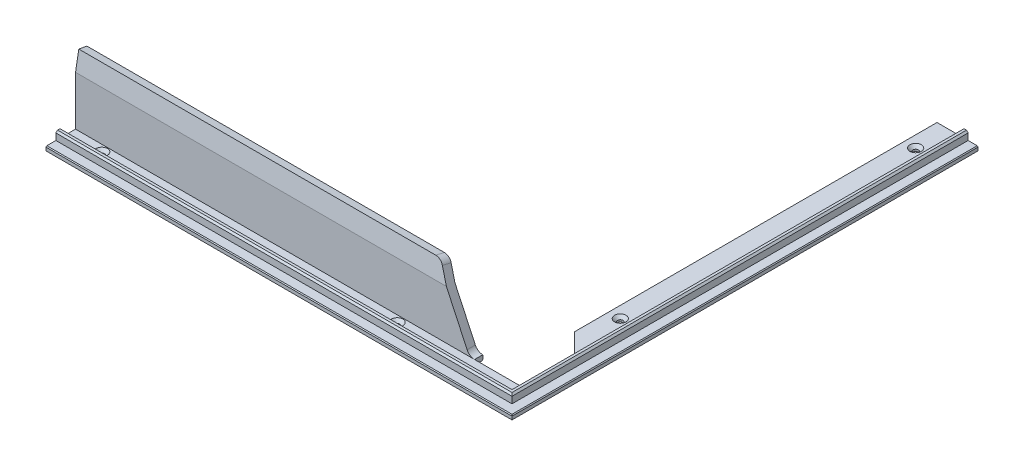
ISO-10303-21;
HEADER;
FILE_DESCRIPTION(('STEP AP214'),'2;1');
FILE_NAME('part.step','',(''),(''),'','','');
FILE_SCHEMA(('AUTOMOTIVE_DESIGN { 1 0 10303 214 1 1 1 1 }'));
ENDSEC;
DATA;
#1=APPLICATION_CONTEXT('core data for automotive mechanical design processes');
#2=APPLICATION_PROTOCOL_DEFINITION('international standard','automotive_design',2000,#1);
#3=PRODUCT_CONTEXT('',#1,'mechanical');
#4=PRODUCT('Part','Part','',(#3));
#5=PRODUCT_RELATED_PRODUCT_CATEGORY('part','',(#4));
#6=PRODUCT_DEFINITION_FORMATION('','',#4);
#7=PRODUCT_DEFINITION_CONTEXT('part definition',#1,'design');
#8=PRODUCT_DEFINITION('design','',#6,#7);
#9=PRODUCT_DEFINITION_SHAPE('','',#8);
#10=(LENGTH_UNIT() NAMED_UNIT(*) SI_UNIT(.MILLI.,.METRE.));
#11=(NAMED_UNIT(*) PLANE_ANGLE_UNIT() SI_UNIT($,.RADIAN.));
#12=(NAMED_UNIT(*) SI_UNIT($,.STERADIAN.) SOLID_ANGLE_UNIT());
#13=UNCERTAINTY_MEASURE_WITH_UNIT(LENGTH_MEASURE(1.E-05),#10,'distance_accuracy_value','');
#14=(GEOMETRIC_REPRESENTATION_CONTEXT(3) GLOBAL_UNCERTAINTY_ASSIGNED_CONTEXT((#13)) GLOBAL_UNIT_ASSIGNED_CONTEXT((#10,
#11,#12)) REPRESENTATION_CONTEXT('',''));
#15=CARTESIAN_POINT('',(0.,0.,0.));
#16=DIRECTION('',(0.,0.,1.));
#17=DIRECTION('',(1.,0.,0.));
#18=AXIS2_PLACEMENT_3D('',#15,#16,#17);
#19=CARTESIAN_POINT('',(518.,3.,0.));
#20=DIRECTION('',(0.,-1.,0.));
#21=DIRECTION('',(0.,0.,-1.));
#22=AXIS2_PLACEMENT_3D('',#19,#20,#21);
#23=PLANE('',#22);
#24=CARTESIAN_POINT('',(525.,3.,-241.));
#25=DIRECTION('',(0.,-1.,0.));
#26=DIRECTION('',(0.,0.,1.));
#27=AXIS2_PLACEMENT_3D('',#24,#25,#26);
#28=CIRCLE('',#27,3.5);
#29=CARTESIAN_POINT('',(525.,3.,-237.5));
#30=VERTEX_POINT('',#29);
#31=EDGE_CURVE('E377',#30,#30,#28,.T.);
#32=ORIENTED_EDGE('',*,*,#31,.T.);
#33=EDGE_LOOP('',(#32));
#34=FACE_BOUND('',#33,.T.);
#35=CARTESIAN_POINT('',(525.,3.,-61.0000000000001));
#36=DIRECTION('',(0.,-1.,0.));
#37=DIRECTION('',(0.,0.,1.));
#38=AXIS2_PLACEMENT_3D('',#35,#36,#37);
#39=CIRCLE('',#38,3.5);
#40=CARTESIAN_POINT('',(525.,3.,-57.5000000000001));
#41=VERTEX_POINT('',#40);
#42=EDGE_CURVE('E365',#41,#41,#39,.T.);
#43=ORIENTED_EDGE('',*,*,#42,.T.);
#44=EDGE_LOOP('',(#43));
#45=FACE_BOUND('',#44,.T.);
#46=DIRECTION('',(0.,0.,-1.));
#47=VECTOR('',#46,1.);
#48=CARTESIAN_POINT('',(518.,3.,0.));
#49=LINE('',#48,#47);
#50=CARTESIAN_POINT('',(518.,3.,-40.));
#51=VERTEX_POINT('',#50);
#52=CARTESIAN_POINT('',(518.,3.,-261.));
#53=VERTEX_POINT('',#52);
#54=EDGE_CURVE('E435',#51,#53,#49,.T.);
#55=ORIENTED_EDGE('',*,*,#54,.F.);
#56=DIRECTION('',(-0.707106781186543,0.,-0.707106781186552));
#57=VECTOR('',#56,1.);
#58=CARTESIAN_POINT('',(534.,3.,-23.9999999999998));
#59=LINE('',#58,#57);
#60=CARTESIAN_POINT('',(534.,3.,-23.9999999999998));
#61=VERTEX_POINT('',#60);
#62=EDGE_CURVE('E266',#61,#51,#59,.T.);
#63=ORIENTED_EDGE('',*,*,#62,.F.);
#64=DIRECTION('',(0.,0.,-1.));
#65=VECTOR('',#64,1.);
#66=CARTESIAN_POINT('',(534.,3.,14.));
#67=LINE('',#66,#65);
#68=CARTESIAN_POINT('',(534.,3.,-261.));
#69=VERTEX_POINT('',#68);
#70=EDGE_CURVE('E413',#61,#69,#67,.T.);
#71=ORIENTED_EDGE('',*,*,#70,.T.);
#72=DIRECTION('',(1.,0.,0.));
#73=VECTOR('',#72,1.);
#74=CARTESIAN_POINT('',(518.,3.,-261.));
#75=LINE('',#74,#73);
#76=EDGE_CURVE('E439',#53,#69,#75,.T.);
#77=ORIENTED_EDGE('',*,*,#76,.F.);
#78=EDGE_LOOP('',(#55,#63,#71,#77));
#79=FACE_BOUND('',#78,.T.);
#80=ADVANCED_FACE('F40',(#34,#45,#79),#23,.F.);
#81=CARTESIAN_POINT('',(279.,3.,8.99999999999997));
#82=DIRECTION('',(0.,-1.,0.));
#83=DIRECTION('',(0.,0.,1.));
#84=AXIS2_PLACEMENT_3D('',#81,#82,#83);
#85=CIRCLE('',#84,3.5);
#86=CARTESIAN_POINT('',(279.,3.,12.5));
#87=VERTEX_POINT('',#86);
#88=EDGE_CURVE('E329',#87,#87,#85,.T.);
#89=ORIENTED_EDGE('',*,*,#88,.T.);
#90=EDGE_LOOP('',(#89));
#91=FACE_BOUND('',#90,.T.);
#92=CARTESIAN_POINT('',(459.,3.,8.99999999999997));
#93=DIRECTION('',(0.,-1.,0.));
#94=DIRECTION('',(0.,0.,1.));
#95=AXIS2_PLACEMENT_3D('',#92,#93,#94);
#96=CIRCLE('',#95,3.5);
#97=CARTESIAN_POINT('',(459.,3.,12.5));
#98=VERTEX_POINT('',#97);
#99=EDGE_CURVE('E353',#98,#98,#96,.T.);
#100=ORIENTED_EDGE('',*,*,#99,.T.);
#101=EDGE_LOOP('',(#100));
#102=FACE_BOUND('',#101,.T.);
#103=CARTESIAN_POINT('',(534.,3.,14.));
#104=VERTEX_POINT('',#103);
#105=CARTESIAN_POINT('',(534.,3.,5.));
#106=VERTEX_POINT('',#105);
#107=EDGE_CURVE('E395',#104,#106,#67,.T.);
#108=ORIENTED_EDGE('',*,*,#107,.T.);
#109=DIRECTION('',(1.,0.,0.));
#110=VECTOR('',#109,1.);
#111=CARTESIAN_POINT('',(502.185351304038,3.,5.));
#112=LINE('',#111,#110);
#113=CARTESIAN_POINT('',(502.185351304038,3.,5.));
#114=VERTEX_POINT('',#113);
#115=EDGE_CURVE('E270',#114,#106,#112,.T.);
#116=ORIENTED_EDGE('',*,*,#115,.F.);
#117=DIRECTION('',(-1.,0.,0.));
#118=VECTOR('',#117,1.);
#119=CARTESIAN_POINT('',(499.,3.,5.));
#120=LINE('',#119,#118);
#121=CARTESIAN_POINT('',(259.,3.,5.));
#122=VERTEX_POINT('',#121);
#123=EDGE_CURVE('E325',#114,#122,#120,.T.);
#124=ORIENTED_EDGE('',*,*,#123,.T.);
#125=DIRECTION('',(0.,0.,-1.));
#126=VECTOR('',#125,1.);
#127=CARTESIAN_POINT('',(259.,3.,23.));
#128=LINE('',#127,#126);
#129=CARTESIAN_POINT('',(259.,3.,14.));
#130=VERTEX_POINT('',#129);
#131=EDGE_CURVE('E443',#130,#122,#128,.T.);
#132=ORIENTED_EDGE('',*,*,#131,.F.);
#133=DIRECTION('',(1.,0.,0.));
#134=VECTOR('',#133,1.);
#135=CARTESIAN_POINT('',(259.,3.,14.));
#136=LINE('',#135,#134);
#137=EDGE_CURVE('E409',#130,#104,#136,.T.);
#138=ORIENTED_EDGE('',*,*,#137,.T.);
#139=EDGE_LOOP('',(#108,#116,#124,#132,#138));
#140=FACE_BOUND('',#139,.T.);
#141=ADVANCED_FACE('F634',(#91,#102,#140),#23,.F.);
#142=CARTESIAN_POINT('',(537.,3.,-261.));
#143=VERTEX_POINT('',#142);
#144=CARTESIAN_POINT('',(542.5,3.,-261.));
#145=VERTEX_POINT('',#144);
#146=EDGE_CURVE('E438',#143,#145,#75,.T.);
#147=ORIENTED_EDGE('',*,*,#146,.F.);
#148=DIRECTION('',(0.,0.,1.));
#149=VECTOR('',#148,1.);
#150=CARTESIAN_POINT('',(537.,3.,-261.));
#151=LINE('',#150,#149);
#152=CARTESIAN_POINT('',(537.,3.,17.));
#153=VERTEX_POINT('',#152);
#154=EDGE_CURVE('E400',#143,#153,#151,.T.);
#155=ORIENTED_EDGE('',*,*,#154,.T.);
#156=DIRECTION('',(-1.,0.,0.));
#157=VECTOR('',#156,1.);
#158=CARTESIAN_POINT('',(537.,3.,17.));
#159=LINE('',#158,#157);
#160=CARTESIAN_POINT('',(259.,3.,17.));
#161=VERTEX_POINT('',#160);
#162=EDGE_CURVE('E404',#153,#161,#159,.T.);
#163=ORIENTED_EDGE('',*,*,#162,.T.);
#164=CARTESIAN_POINT('',(259.,3.,22.5));
#165=VERTEX_POINT('',#164);
#166=EDGE_CURVE('E444',#165,#161,#128,.T.);
#167=ORIENTED_EDGE('',*,*,#166,.F.);
#168=DIRECTION('',(-1.,0.,0.));
#169=VECTOR('',#168,1.);
#170=CARTESIAN_POINT('',(518.,3.,22.5));
#171=LINE('',#170,#169);
#172=CARTESIAN_POINT('',(542.5,3.,22.5));
#173=VERTEX_POINT('',#172);
#174=EDGE_CURVE('E534',#173,#165,#171,.T.);
#175=ORIENTED_EDGE('',*,*,#174,.F.);
#176=DIRECTION('',(0.,0.,1.));
#177=VECTOR('',#176,1.);
#178=CARTESIAN_POINT('',(542.5,3.,0.));
#179=LINE('',#178,#177);
#180=EDGE_CURVE('E538',#145,#173,#179,.T.);
#181=ORIENTED_EDGE('',*,*,#180,.F.);
#182=EDGE_LOOP('',(#147,#155,#163,#167,#175,#181));
#183=FACE_BOUND('',#182,.T.);
#184=ADVANCED_FACE('F686',(#183),#23,.F.);
#185=CARTESIAN_POINT('',(259.,3.,0.));
#186=DIRECTION('',(0.,0.,1.));
#187=DIRECTION('',(-1.,0.,0.));
#188=AXIS2_PLACEMENT_3D('',#185,#186,#187);
#189=PLANE('',#188);
#190=CARTESIAN_POINT('',(502.185351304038,8.,0.));
#191=DIRECTION('',(0.,0.,-1.));
#192=DIRECTION('',(-1.,0.,0.));
#193=AXIS2_PLACEMENT_3D('',#190,#191,#192);
#194=CIRCLE('',#193,5.);
#195=CARTESIAN_POINT('',(502.185351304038,3.,0.));
#196=VERTEX_POINT('',#195);
#197=CARTESIAN_POINT('',(497.653812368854,5.88690869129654,0.));
#198=VERTEX_POINT('',#197);
#199=EDGE_CURVE('E618',#196,#198,#194,.T.);
#200=ORIENTED_EDGE('',*,*,#199,.F.);
#201=DIRECTION('',(0.,1.,0.));
#202=VECTOR('',#201,1.);
#203=CARTESIAN_POINT('',(502.185351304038,0.,0.));
#204=LINE('',#203,#202);
#205=CARTESIAN_POINT('',(502.185351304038,0.500000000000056,0.));
#206=VERTEX_POINT('',#205);
#207=EDGE_CURVE('E56',#206,#196,#204,.T.);
#208=ORIENTED_EDGE('',*,*,#207,.F.);
#209=DIRECTION('',(1.,0.,0.));
#210=VECTOR('',#209,1.);
#211=CARTESIAN_POINT('',(518.,0.500000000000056,0.));
#212=LINE('',#211,#210);
#213=CARTESIAN_POINT('',(259.,0.500000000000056,0.));
#214=VERTEX_POINT('',#213);
#215=EDGE_CURVE('E530',#214,#206,#212,.T.);
#216=ORIENTED_EDGE('',*,*,#215,.F.);
#217=DIRECTION('',(0.,-1.,0.));
#218=VECTOR('',#217,1.);
#219=CARTESIAN_POINT('',(259.,3.,0.));
#220=LINE('',#219,#218);
#221=CARTESIAN_POINT('',(259.,32.5625566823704,0.));
#222=VERTEX_POINT('',#221);
#223=EDGE_CURVE('E448',#222,#214,#220,.T.);
#224=ORIENTED_EDGE('',*,*,#223,.F.);
#225=DIRECTION('',(-1.,0.,0.));
#226=VECTOR('',#225,1.);
#227=CARTESIAN_POINT('',(499.,32.5625566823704,0.));
#228=LINE('',#227,#226);
#229=CARTESIAN_POINT('',(485.21475342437,32.5625566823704,0.));
#230=VERTEX_POINT('',#229);
#231=EDGE_CURVE('E324',#230,#222,#228,.T.);
#232=ORIENTED_EDGE('',*,*,#231,.F.);
#233=DIRECTION('',(-0.422618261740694,0.906307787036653,0.));
#234=VECTOR('',#233,1.);
#235=CARTESIAN_POINT('',(456.134513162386,94.9253331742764,0.));
#236=LINE('',#235,#234);
#237=EDGE_CURVE('E305',#198,#230,#236,.T.);
#238=ORIENTED_EDGE('',*,*,#237,.F.);
#239=EDGE_LOOP('',(#200,#208,#216,#224,#232,#238));
#240=FACE_BOUND('',#239,.T.);
#241=ADVANCED_FACE('F829',(#240),#189,.F.);
#242=CARTESIAN_POINT('',(518.,3.,0.));
#243=DIRECTION('',(1.,0.,0.));
#244=DIRECTION('',(0.,0.,1.));
#245=AXIS2_PLACEMENT_3D('',#242,#243,#244);
#246=PLANE('',#245);
#247=DIRECTION('',(0.,0.,-1.));
#248=VECTOR('',#247,1.);
#249=CARTESIAN_POINT('',(518.,0.500000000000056,-261.));
#250=LINE('',#249,#248);
#251=CARTESIAN_POINT('',(518.,0.500000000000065,-40.));
#252=VERTEX_POINT('',#251);
#253=CARTESIAN_POINT('',(518.,0.500000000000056,-261.));
#254=VERTEX_POINT('',#253);
#255=EDGE_CURVE('E468',#252,#254,#250,.T.);
#256=ORIENTED_EDGE('',*,*,#255,.F.);
#257=DIRECTION('',(0.,1.,0.));
#258=VECTOR('',#257,1.);
#259=CARTESIAN_POINT('',(518.,0.,-40.));
#260=LINE('',#259,#258);
#261=EDGE_CURVE('E280',#252,#51,#260,.T.);
#262=ORIENTED_EDGE('',*,*,#261,.T.);
#263=ORIENTED_EDGE('',*,*,#54,.T.);
#264=DIRECTION('',(0.,-1.,0.));
#265=VECTOR('',#264,1.);
#266=CARTESIAN_POINT('',(518.,3.,-261.));
#267=LINE('',#266,#265);
#268=EDGE_CURVE('E464',#53,#254,#267,.T.);
#269=ORIENTED_EDGE('',*,*,#268,.T.);
#270=EDGE_LOOP('',(#256,#262,#263,#269));
#271=FACE_BOUND('',#270,.T.);
#272=ADVANCED_FACE('F659',(#271),#246,.F.);
#273=CARTESIAN_POINT('',(518.,3.,-261.));
#274=DIRECTION('',(0.,0.,1.));
#275=DIRECTION('',(-1.,0.,0.));
#276=AXIS2_PLACEMENT_3D('',#273,#274,#275);
#277=PLANE('',#276);
#278=DIRECTION('',(0.,-1.,0.));
#279=VECTOR('',#278,1.);
#280=CARTESIAN_POINT('',(537.,8.,-261.));
#281=LINE('',#280,#279);
#282=CARTESIAN_POINT('',(537.,7.,-261.));
#283=VERTEX_POINT('',#282);
#284=EDGE_CURVE('E432',#283,#143,#281,.T.);
#285=ORIENTED_EDGE('',*,*,#284,.T.);
#286=ORIENTED_EDGE('',*,*,#146,.T.);
#287=DIRECTION('',(0.707106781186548,-0.707106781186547,0.));
#288=VECTOR('',#287,1.);
#289=CARTESIAN_POINT('',(542.5,2.99999999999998,-261.));
#290=LINE('',#289,#288);
#291=CARTESIAN_POINT('',(543.,2.5,-261.));
#292=VERTEX_POINT('',#291);
#293=EDGE_CURVE('E497',#292,#145,#290,.F.);
#294=ORIENTED_EDGE('',*,*,#293,.F.);
#295=DIRECTION('',(0.,-1.,0.));
#296=VECTOR('',#295,1.);
#297=CARTESIAN_POINT('',(543.,3.,-261.));
#298=LINE('',#297,#296);
#299=CARTESIAN_POINT('',(543.,0.500000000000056,-261.));
#300=VERTEX_POINT('',#299);
#301=EDGE_CURVE('E460',#292,#300,#298,.T.);
#302=ORIENTED_EDGE('',*,*,#301,.T.);
#303=DIRECTION('',(1.,0.,0.));
#304=VECTOR('',#303,1.);
#305=CARTESIAN_POINT('',(543.,0.500000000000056,-261.));
#306=LINE('',#305,#304);
#307=EDGE_CURVE('E500',#254,#300,#306,.T.);
#308=ORIENTED_EDGE('',*,*,#307,.F.);
#309=ORIENTED_EDGE('',*,*,#268,.F.);
#310=ORIENTED_EDGE('',*,*,#76,.T.);
#311=DIRECTION('',(0.,-1.,0.));
#312=VECTOR('',#311,1.);
#313=CARTESIAN_POINT('',(534.,8.,-261.));
#314=LINE('',#313,#312);
#315=CARTESIAN_POINT('',(534.,7.49999999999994,-261.));
#316=VERTEX_POINT('',#315);
#317=EDGE_CURVE('E399',#316,#69,#314,.T.);
#318=ORIENTED_EDGE('',*,*,#317,.F.);
#319=DIRECTION('',(-0.707106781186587,-0.707106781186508,0.));
#320=VECTOR('',#319,1.);
#321=CARTESIAN_POINT('',(534.5,8.00000000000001,-261.));
#322=LINE('',#321,#320);
#323=CARTESIAN_POINT('',(534.5,8.,-261.));
#324=VERTEX_POINT('',#323);
#325=EDGE_CURVE('E493',#324,#316,#322,.T.);
#326=ORIENTED_EDGE('',*,*,#325,.F.);
#327=DIRECTION('',(1.,0.,0.));
#328=VECTOR('',#327,1.);
#329=CARTESIAN_POINT('',(534.,8.,-261.));
#330=LINE('',#329,#328);
#331=CARTESIAN_POINT('',(536.,8.,-261.));
#332=VERTEX_POINT('',#331);
#333=EDGE_CURVE('E390',#324,#332,#330,.T.);
#334=ORIENTED_EDGE('',*,*,#333,.T.);
#335=DIRECTION('',(-0.707106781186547,0.707106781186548,0.));
#336=VECTOR('',#335,1.);
#337=CARTESIAN_POINT('',(536.,8.00000000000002,-261.));
#338=LINE('',#337,#336);
#339=EDGE_CURVE('E588',#283,#332,#338,.T.);
#340=ORIENTED_EDGE('',*,*,#339,.F.);
#341=EDGE_LOOP('',(#285,#286,#294,#302,#308,#309,#310,#318,#326,#334,#340));
#342=FACE_BOUND('',#341,.T.);
#343=ADVANCED_FACE('F654',(#342),#277,.F.);
#344=CARTESIAN_POINT('',(543.,3.,-261.));
#345=DIRECTION('',(-1.,0.,0.));
#346=DIRECTION('',(0.,0.,-1.));
#347=AXIS2_PLACEMENT_3D('',#344,#345,#346);
#348=PLANE('',#347);
#349=ORIENTED_EDGE('',*,*,#301,.F.);
#350=DIRECTION('',(0.,0.,-1.));
#351=VECTOR('',#350,1.);
#352=CARTESIAN_POINT('',(543.,2.5,-261.));
#353=LINE('',#352,#351);
#354=CARTESIAN_POINT('',(543.,2.5,23.));
#355=VERTEX_POINT('',#354);
#356=EDGE_CURVE('E504',#355,#292,#353,.T.);
#357=ORIENTED_EDGE('',*,*,#356,.F.);
#358=DIRECTION('',(0.,-1.,0.));
#359=VECTOR('',#358,1.);
#360=CARTESIAN_POINT('',(543.,3.,23.));
#361=LINE('',#360,#359);
#362=CARTESIAN_POINT('',(543.,0.500000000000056,23.));
#363=VERTEX_POINT('',#362);
#364=EDGE_CURVE('E456',#355,#363,#361,.T.);
#365=ORIENTED_EDGE('',*,*,#364,.T.);
#366=DIRECTION('',(0.,0.,1.));
#367=VECTOR('',#366,1.);
#368=CARTESIAN_POINT('',(543.,0.500000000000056,23.));
#369=LINE('',#368,#367);
#370=EDGE_CURVE('E507',#300,#363,#369,.T.);
#371=ORIENTED_EDGE('',*,*,#370,.F.);
#372=EDGE_LOOP('',(#349,#357,#365,#371));
#373=FACE_BOUND('',#372,.T.);
#374=ADVANCED_FACE('F1079',(#373),#348,.F.);
#375=CARTESIAN_POINT('',(543.,3.,23.));
#376=DIRECTION('',(0.,0.,-1.));
#377=DIRECTION('',(1.,0.,0.));
#378=AXIS2_PLACEMENT_3D('',#375,#376,#377);
#379=PLANE('',#378);
#380=ORIENTED_EDGE('',*,*,#364,.F.);
#381=DIRECTION('',(1.,0.,0.));
#382=VECTOR('',#381,1.);
#383=CARTESIAN_POINT('',(543.,2.5,23.));
#384=LINE('',#383,#382);
#385=CARTESIAN_POINT('',(259.,2.5,23.));
#386=VERTEX_POINT('',#385);
#387=EDGE_CURVE('E511',#386,#355,#384,.T.);
#388=ORIENTED_EDGE('',*,*,#387,.F.);
#389=DIRECTION('',(0.,-1.,0.));
#390=VECTOR('',#389,1.);
#391=CARTESIAN_POINT('',(259.,3.,23.));
#392=LINE('',#391,#390);
#393=CARTESIAN_POINT('',(259.,0.500000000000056,23.));
#394=VERTEX_POINT('',#393);
#395=EDGE_CURVE('E452',#386,#394,#392,.T.);
#396=ORIENTED_EDGE('',*,*,#395,.T.);
#397=DIRECTION('',(-1.,0.,0.));
#398=VECTOR('',#397,1.);
#399=CARTESIAN_POINT('',(259.,0.500000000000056,23.));
#400=LINE('',#399,#398);
#401=EDGE_CURVE('E515',#363,#394,#400,.T.);
#402=ORIENTED_EDGE('',*,*,#401,.F.);
#403=EDGE_LOOP('',(#380,#388,#396,#402));
#404=FACE_BOUND('',#403,.T.);
#405=ADVANCED_FACE('F1090',(#404),#379,.F.);
#406=CARTESIAN_POINT('',(259.,3.,23.));
#407=DIRECTION('',(1.,0.,0.));
#408=DIRECTION('',(0.,0.,1.));
#409=AXIS2_PLACEMENT_3D('',#406,#407,#408);
#410=PLANE('',#409);
#411=DIRECTION('',(0.,0.,-1.));
#412=VECTOR('',#411,1.);
#413=CARTESIAN_POINT('',(259.,8.,17.));
#414=LINE('',#413,#412);
#415=CARTESIAN_POINT('',(259.,8.,16.));
#416=VERTEX_POINT('',#415);
#417=CARTESIAN_POINT('',(259.,8.,14.5000000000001));
#418=VERTEX_POINT('',#417);
#419=EDGE_CURVE('E394',#416,#418,#414,.T.);
#420=ORIENTED_EDGE('',*,*,#419,.T.);
#421=DIRECTION('',(0.,0.707106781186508,0.707106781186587));
#422=VECTOR('',#421,1.);
#423=CARTESIAN_POINT('',(259.,8.00000000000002,14.5000000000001));
#424=LINE('',#423,#422);
#425=CARTESIAN_POINT('',(259.,7.49999999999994,14.));
#426=VERTEX_POINT('',#425);
#427=EDGE_CURVE('E519',#426,#418,#424,.T.);
#428=ORIENTED_EDGE('',*,*,#427,.F.);
#429=DIRECTION('',(0.,-1.,0.));
#430=VECTOR('',#429,1.);
#431=CARTESIAN_POINT('',(259.,8.,14.));
#432=LINE('',#431,#430);
#433=EDGE_CURVE('E423',#426,#130,#432,.T.);
#434=ORIENTED_EDGE('',*,*,#433,.T.);
#435=ORIENTED_EDGE('',*,*,#131,.T.);
#436=DIRECTION('',(0.,-1.,0.));
#437=VECTOR('',#436,1.);
#438=CARTESIAN_POINT('',(259.,33.,5.));
#439=LINE('',#438,#437);
#440=CARTESIAN_POINT('',(259.,33.,5.));
#441=VERTEX_POINT('',#440);
#442=EDGE_CURVE('E321',#441,#122,#439,.T.);
#443=ORIENTED_EDGE('',*,*,#442,.F.);
#444=DIRECTION('',(0.,-0.984807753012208,0.173648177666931));
#445=VECTOR('',#444,1.);
#446=CARTESIAN_POINT('',(259.,44.2636828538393,3.0139088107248));
#447=LINE('',#446,#445);
#448=CARTESIAN_POINT('',(259.,44.2636828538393,3.0139088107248));
#449=VERTEX_POINT('',#448);
#450=EDGE_CURVE('E317',#449,#441,#447,.T.);
#451=ORIENTED_EDGE('',*,*,#450,.F.);
#452=DIRECTION('',(0.,0.173648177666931,0.984807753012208));
#453=VECTOR('',#452,1.);
#454=CARTESIAN_POINT('',(259.,43.3954419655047,-1.91012995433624));
#455=LINE('',#454,#453);
#456=CARTESIAN_POINT('',(259.,43.3954419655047,-1.91012995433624));
#457=VERTEX_POINT('',#456);
#458=EDGE_CURVE('E313',#457,#449,#455,.T.);
#459=ORIENTED_EDGE('',*,*,#458,.F.);
#460=DIRECTION('',(0.,0.984807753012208,-0.173648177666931));
#461=VECTOR('',#460,1.);
#462=CARTESIAN_POINT('',(259.,32.5625566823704,0.));
#463=LINE('',#462,#461);
#464=EDGE_CURVE('E309',#222,#457,#463,.T.);
#465=ORIENTED_EDGE('',*,*,#464,.F.);
#466=ORIENTED_EDGE('',*,*,#223,.T.);
#467=DIRECTION('',(0.,0.,-1.));
#468=VECTOR('',#467,1.);
#469=CARTESIAN_POINT('',(259.,0.500000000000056,0.));
#470=LINE('',#469,#468);
#471=EDGE_CURVE('E526',#394,#214,#470,.T.);
#472=ORIENTED_EDGE('',*,*,#471,.F.);
#473=ORIENTED_EDGE('',*,*,#395,.F.);
#474=DIRECTION('',(0.,0.707106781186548,-0.707106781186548));
#475=VECTOR('',#474,1.);
#476=CARTESIAN_POINT('',(259.,3.,22.5));
#477=LINE('',#476,#475);
#478=EDGE_CURVE('E523',#165,#386,#477,.F.);
#479=ORIENTED_EDGE('',*,*,#478,.F.);
#480=ORIENTED_EDGE('',*,*,#166,.T.);
#481=DIRECTION('',(0.,-1.,0.));
#482=VECTOR('',#481,1.);
#483=CARTESIAN_POINT('',(259.,8.,17.));
#484=LINE('',#483,#482);
#485=CARTESIAN_POINT('',(259.,7.,17.));
#486=VERTEX_POINT('',#485);
#487=EDGE_CURVE('E426',#486,#161,#484,.T.);
#488=ORIENTED_EDGE('',*,*,#487,.F.);
#489=DIRECTION('',(0.,-0.707106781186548,0.707106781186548));
#490=VECTOR('',#489,1.);
#491=CARTESIAN_POINT('',(259.,8.,16.));
#492=LINE('',#491,#490);
#493=EDGE_CURVE('E592',#416,#486,#492,.T.);
#494=ORIENTED_EDGE('',*,*,#493,.F.);
#495=EDGE_LOOP('',(#420,#428,#434,#435,#443,#451,#459,#465,#466,#472,#473,#479,#480,#488,#494));
#496=FACE_BOUND('',#495,.T.);
#497=ADVANCED_FACE('F792',(#496),#410,.F.);
#498=CARTESIAN_POINT('',(518.,0.,0.));
#499=DIRECTION('',(0.,-1.,0.));
#500=DIRECTION('',(0.,0.,-1.));
#501=AXIS2_PLACEMENT_3D('',#498,#499,#500);
#502=PLANE('',#501);
#503=DIRECTION('',(-0.707106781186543,0.,-0.707106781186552));
#504=VECTOR('',#503,1.);
#505=CARTESIAN_POINT('',(534.,0.,-23.9999999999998));
#506=LINE('',#505,#504);
#507=CARTESIAN_POINT('',(534.,0.,-23.9999999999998));
#508=VERTEX_POINT('',#507);
#509=CARTESIAN_POINT('',(518.5,0.,-39.5000000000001));
#510=VERTEX_POINT('',#509);
#511=EDGE_CURVE('E275',#508,#510,#506,.T.);
#512=ORIENTED_EDGE('',*,*,#511,.T.);
#513=DIRECTION('',(0.,0.,1.));
#514=VECTOR('',#513,1.);
#515=CARTESIAN_POINT('',(518.5,0.,0.));
#516=LINE('',#515,#514);
#517=CARTESIAN_POINT('',(518.5,0.,-260.5));
#518=VERTEX_POINT('',#517);
#519=EDGE_CURVE('E489',#518,#510,#516,.T.);
#520=ORIENTED_EDGE('',*,*,#519,.F.);
#521=DIRECTION('',(-1.,0.,0.));
#522=VECTOR('',#521,1.);
#523=CARTESIAN_POINT('',(518.,0.,-260.5));
#524=LINE('',#523,#522);
#525=CARTESIAN_POINT('',(542.5,0.,-260.5));
#526=VERTEX_POINT('',#525);
#527=EDGE_CURVE('E485',#526,#518,#524,.T.);
#528=ORIENTED_EDGE('',*,*,#527,.F.);
#529=DIRECTION('',(0.,0.,-1.));
#530=VECTOR('',#529,1.);
#531=CARTESIAN_POINT('',(542.5,0.,-261.));
#532=LINE('',#531,#530);
#533=CARTESIAN_POINT('',(542.5,0.,22.5));
#534=VERTEX_POINT('',#533);
#535=EDGE_CURVE('E481',#534,#526,#532,.T.);
#536=ORIENTED_EDGE('',*,*,#535,.F.);
#537=DIRECTION('',(1.,0.,0.));
#538=VECTOR('',#537,1.);
#539=CARTESIAN_POINT('',(543.,0.,22.5));
#540=LINE('',#539,#538);
#541=CARTESIAN_POINT('',(259.5,0.,22.5));
#542=VERTEX_POINT('',#541);
#543=EDGE_CURVE('E477',#542,#534,#540,.T.);
#544=ORIENTED_EDGE('',*,*,#543,.F.);
#545=DIRECTION('',(0.,0.,1.));
#546=VECTOR('',#545,1.);
#547=CARTESIAN_POINT('',(259.5,0.,23.));
#548=LINE('',#547,#546);
#549=CARTESIAN_POINT('',(259.5,0.,0.499999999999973));
#550=VERTEX_POINT('',#549);
#551=EDGE_CURVE('E473',#550,#542,#548,.T.);
#552=ORIENTED_EDGE('',*,*,#551,.F.);
#553=DIRECTION('',(-1.,0.,0.));
#554=VECTOR('',#553,1.);
#555=CARTESIAN_POINT('',(259.,0.,0.499999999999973));
#556=LINE('',#555,#554);
#557=CARTESIAN_POINT('',(502.185351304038,0.,0.5));
#558=VERTEX_POINT('',#557);
#559=EDGE_CURVE('E264',#558,#550,#556,.T.);
#560=ORIENTED_EDGE('',*,*,#559,.F.);
#561=DIRECTION('',(0.,0.,1.));
#562=VECTOR('',#561,1.);
#563=CARTESIAN_POINT('',(502.185351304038,0.,0.));
#564=LINE('',#563,#562);
#565=CARTESIAN_POINT('',(502.185351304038,0.,5.));
#566=VERTEX_POINT('',#565);
#567=EDGE_CURVE('E240',#558,#566,#564,.T.);
#568=ORIENTED_EDGE('',*,*,#567,.T.);
#569=DIRECTION('',(1.,0.,0.));
#570=VECTOR('',#569,1.);
#571=CARTESIAN_POINT('',(502.185351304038,0.,5.));
#572=LINE('',#571,#570);
#573=CARTESIAN_POINT('',(534.,0.,5.));
#574=VERTEX_POINT('',#573);
#575=EDGE_CURVE('E251',#566,#574,#572,.T.);
#576=ORIENTED_EDGE('',*,*,#575,.T.);
#577=DIRECTION('',(0.,0.,-1.));
#578=VECTOR('',#577,1.);
#579=CARTESIAN_POINT('',(534.,0.,5.));
#580=LINE('',#579,#578);
#581=EDGE_CURVE('E257',#574,#508,#580,.T.);
#582=ORIENTED_EDGE('',*,*,#581,.T.);
#583=EDGE_LOOP('',(#512,#520,#528,#536,#544,#552,#560,#568,#576,#582));
#584=FACE_BOUND('',#583,.T.);
#585=CARTESIAN_POINT('',(279.,0.,8.99999999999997));
#586=DIRECTION('',(0.,-1.,0.));
#587=DIRECTION('',(0.,0.,1.));
#588=AXIS2_PLACEMENT_3D('',#585,#586,#587);
#589=CIRCLE('',#588,1.70000000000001);
#590=CARTESIAN_POINT('',(279.,0.,10.7));
#591=VERTEX_POINT('',#590);
#592=EDGE_CURVE('E349',#591,#591,#589,.T.);
#593=ORIENTED_EDGE('',*,*,#592,.F.);
#594=EDGE_LOOP('',(#593));
#595=FACE_BOUND('',#594,.T.);
#596=CARTESIAN_POINT('',(459.,0.,8.99999999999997));
#597=DIRECTION('',(0.,-1.,0.));
#598=DIRECTION('',(0.,0.,1.));
#599=AXIS2_PLACEMENT_3D('',#596,#597,#598);
#600=CIRCLE('',#599,1.7);
#601=CARTESIAN_POINT('',(459.,0.,10.7));
#602=VERTEX_POINT('',#601);
#603=EDGE_CURVE('E361',#602,#602,#600,.T.);
#604=ORIENTED_EDGE('',*,*,#603,.F.);
#605=EDGE_LOOP('',(#604));
#606=FACE_BOUND('',#605,.T.);
#607=CARTESIAN_POINT('',(525.,0.,-61.0000000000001));
#608=DIRECTION('',(0.,-1.,0.));
#609=DIRECTION('',(0.,0.,1.));
#610=AXIS2_PLACEMENT_3D('',#607,#608,#609);
#611=CIRCLE('',#610,1.7);
#612=CARTESIAN_POINT('',(525.,0.,-59.3000000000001));
#613=VERTEX_POINT('',#612);
#614=EDGE_CURVE('E373',#613,#613,#611,.T.);
#615=ORIENTED_EDGE('',*,*,#614,.F.);
#616=EDGE_LOOP('',(#615));
#617=FACE_BOUND('',#616,.T.);
#618=CARTESIAN_POINT('',(525.,0.,-241.));
#619=DIRECTION('',(0.,-1.,0.));
#620=DIRECTION('',(0.,0.,1.));
#621=AXIS2_PLACEMENT_3D('',#618,#619,#620);
#622=CIRCLE('',#621,1.7);
#623=CARTESIAN_POINT('',(525.,0.,-239.3));
#624=VERTEX_POINT('',#623);
#625=EDGE_CURVE('E385',#624,#624,#622,.T.);
#626=ORIENTED_EDGE('',*,*,#625,.F.);
#627=EDGE_LOOP('',(#626));
#628=FACE_BOUND('',#627,.T.);
#629=ADVANCED_FACE('F261',(#584,#595,#606,#617,#628),#502,.T.);
#630=CARTESIAN_POINT('',(537.,8.,-261.));
#631=DIRECTION('',(-1.,0.,0.));
#632=DIRECTION('',(0.,0.,-1.));
#633=AXIS2_PLACEMENT_3D('',#630,#631,#632);
#634=PLANE('',#633);
#635=DIRECTION('',(0.,-1.,0.));
#636=VECTOR('',#635,1.);
#637=CARTESIAN_POINT('',(537.,8.,17.));
#638=LINE('',#637,#636);
#639=CARTESIAN_POINT('',(537.,7.,17.));
#640=VERTEX_POINT('',#639);
#641=EDGE_CURVE('E429',#640,#153,#638,.T.);
#642=ORIENTED_EDGE('',*,*,#641,.T.);
#643=ORIENTED_EDGE('',*,*,#154,.F.);
#644=ORIENTED_EDGE('',*,*,#284,.F.);
#645=DIRECTION('',(0.,0.,-1.));
#646=VECTOR('',#645,1.);
#647=CARTESIAN_POINT('',(537.,7.,-261.));
#648=LINE('',#647,#646);
#649=EDGE_CURVE('E585',#640,#283,#648,.T.);
#650=ORIENTED_EDGE('',*,*,#649,.F.);
#651=EDGE_LOOP('',(#642,#643,#644,#650));
#652=FACE_BOUND('',#651,.T.);
#653=ADVANCED_FACE('F680',(#652),#634,.F.);
#654=CARTESIAN_POINT('',(537.,8.,17.));
#655=DIRECTION('',(0.,0.,-1.));
#656=DIRECTION('',(1.,0.,0.));
#657=AXIS2_PLACEMENT_3D('',#654,#655,#656);
#658=PLANE('',#657);
#659=ORIENTED_EDGE('',*,*,#487,.T.);
#660=ORIENTED_EDGE('',*,*,#162,.F.);
#661=ORIENTED_EDGE('',*,*,#641,.F.);
#662=DIRECTION('',(1.,0.,0.));
#663=VECTOR('',#662,1.);
#664=CARTESIAN_POINT('',(537.,7.,17.));
#665=LINE('',#664,#663);
#666=EDGE_CURVE('E596',#486,#640,#665,.T.);
#667=ORIENTED_EDGE('',*,*,#666,.F.);
#668=EDGE_LOOP('',(#659,#660,#661,#667));
#669=FACE_BOUND('',#668,.T.);
#670=ADVANCED_FACE('F1124',(#669),#658,.F.);
#671=CARTESIAN_POINT('',(259.,8.,14.));
#672=DIRECTION('',(0.,0.,1.));
#673=DIRECTION('',(-1.,0.,0.));
#674=AXIS2_PLACEMENT_3D('',#671,#672,#673);
#675=PLANE('',#674);
#676=DIRECTION('',(0.,-1.,0.));
#677=VECTOR('',#676,1.);
#678=CARTESIAN_POINT('',(534.,8.,14.));
#679=LINE('',#678,#677);
#680=CARTESIAN_POINT('',(534.,7.49999999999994,14.));
#681=VERTEX_POINT('',#680);
#682=EDGE_CURVE('E420',#681,#104,#679,.T.);
#683=ORIENTED_EDGE('',*,*,#682,.T.);
#684=ORIENTED_EDGE('',*,*,#137,.F.);
#685=ORIENTED_EDGE('',*,*,#433,.F.);
#686=DIRECTION('',(-1.,0.,0.));
#687=VECTOR('',#686,1.);
#688=CARTESIAN_POINT('',(259.,7.49999999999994,14.));
#689=LINE('',#688,#687);
#690=EDGE_CURVE('E553',#681,#426,#689,.T.);
#691=ORIENTED_EDGE('',*,*,#690,.F.);
#692=EDGE_LOOP('',(#683,#684,#685,#691));
#693=FACE_BOUND('',#692,.T.);
#694=ADVANCED_FACE('F797',(#693),#675,.F.);
#695=CARTESIAN_POINT('',(534.,8.,14.));
#696=DIRECTION('',(1.,0.,0.));
#697=DIRECTION('',(0.,0.,1.));
#698=AXIS2_PLACEMENT_3D('',#695,#696,#697);
#699=PLANE('',#698);
#700=ORIENTED_EDGE('',*,*,#317,.T.);
#701=ORIENTED_EDGE('',*,*,#70,.F.);
#702=DIRECTION('',(0.,1.,0.));
#703=VECTOR('',#702,1.);
#704=CARTESIAN_POINT('',(534.,0.,-23.9999999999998));
#705=LINE('',#704,#703);
#706=EDGE_CURVE('E285',#508,#61,#705,.T.);
#707=ORIENTED_EDGE('',*,*,#706,.F.);
#708=ORIENTED_EDGE('',*,*,#581,.F.);
#709=DIRECTION('',(0.,1.,0.));
#710=VECTOR('',#709,1.);
#711=CARTESIAN_POINT('',(534.,0.,5.));
#712=LINE('',#711,#710);
#713=EDGE_CURVE('E248',#574,#106,#712,.T.);
#714=ORIENTED_EDGE('',*,*,#713,.T.);
#715=ORIENTED_EDGE('',*,*,#107,.F.);
#716=ORIENTED_EDGE('',*,*,#682,.F.);
#717=DIRECTION('',(0.,0.,1.));
#718=VECTOR('',#717,1.);
#719=CARTESIAN_POINT('',(534.,7.49999999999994,14.));
#720=LINE('',#719,#718);
#721=EDGE_CURVE('E549',#316,#681,#720,.T.);
#722=ORIENTED_EDGE('',*,*,#721,.F.);
#723=EDGE_LOOP('',(#700,#701,#707,#708,#714,#715,#716,#722));
#724=FACE_BOUND('',#723,.T.);
#725=ADVANCED_FACE('F639',(#724),#699,.F.);
#726=CARTESIAN_POINT('',(518.,8.,0.));
#727=DIRECTION('',(0.,1.,0.));
#728=DIRECTION('',(0.,0.,1.));
#729=AXIS2_PLACEMENT_3D('',#726,#727,#728);
#730=PLANE('',#729);
#731=ORIENTED_EDGE('',*,*,#333,.F.);
#732=DIRECTION('',(0.,0.,-1.));
#733=VECTOR('',#732,1.);
#734=CARTESIAN_POINT('',(534.5,8.,-261.));
#735=LINE('',#734,#733);
#736=CARTESIAN_POINT('',(534.5,8.,14.5000000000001));
#737=VERTEX_POINT('',#736);
#738=EDGE_CURVE('E546',#737,#324,#735,.T.);
#739=ORIENTED_EDGE('',*,*,#738,.F.);
#740=DIRECTION('',(1.,0.,0.));
#741=VECTOR('',#740,1.);
#742=CARTESIAN_POINT('',(534.,8.,14.5000000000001));
#743=LINE('',#742,#741);
#744=EDGE_CURVE('E542',#418,#737,#743,.T.);
#745=ORIENTED_EDGE('',*,*,#744,.F.);
#746=ORIENTED_EDGE('',*,*,#419,.F.);
#747=DIRECTION('',(-1.,0.,0.));
#748=VECTOR('',#747,1.);
#749=CARTESIAN_POINT('',(259.,8.,16.));
#750=LINE('',#749,#748);
#751=CARTESIAN_POINT('',(536.,8.,16.));
#752=VERTEX_POINT('',#751);
#753=EDGE_CURVE('E556',#752,#416,#750,.T.);
#754=ORIENTED_EDGE('',*,*,#753,.F.);
#755=DIRECTION('',(0.,0.,1.));
#756=VECTOR('',#755,1.);
#757=CARTESIAN_POINT('',(536.,8.,17.));
#758=LINE('',#757,#756);
#759=EDGE_CURVE('E581',#332,#752,#758,.T.);
#760=ORIENTED_EDGE('',*,*,#759,.F.);
#761=EDGE_LOOP('',(#731,#739,#745,#746,#754,#760));
#762=FACE_BOUND('',#761,.T.);
#763=ADVANCED_FACE('F671',(#762),#730,.T.);
#764=CARTESIAN_POINT('',(543.,0.500000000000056,23.));
#765=DIRECTION('',(0.,-0.707106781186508,0.707106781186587));
#766=DIRECTION('',(1.,0.,0.));
#767=AXIS2_PLACEMENT_3D('',#764,#765,#766);
#768=PLANE('',#767);
#769=DIRECTION('',(-0.577350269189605,-0.577350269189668,-0.577350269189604));
#770=VECTOR('',#769,1.);
#771=CARTESIAN_POINT('',(543.,0.500000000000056,23.));
#772=LINE('',#771,#770);
#773=EDGE_CURVE('E569',#534,#363,#772,.F.);
#774=ORIENTED_EDGE('',*,*,#773,.T.);
#775=ORIENTED_EDGE('',*,*,#401,.T.);
#776=DIRECTION('',(0.577350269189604,-0.577350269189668,-0.577350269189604));
#777=VECTOR('',#776,1.);
#778=CARTESIAN_POINT('',(259.,0.500000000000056,23.));
#779=LINE('',#778,#777);
#780=EDGE_CURVE('E405',#394,#542,#779,.T.);
#781=ORIENTED_EDGE('',*,*,#780,.T.);
#782=ORIENTED_EDGE('',*,*,#543,.T.);
#783=EDGE_LOOP('',(#774,#775,#781,#782));
#784=FACE_BOUND('',#783,.T.);
#785=ADVANCED_FACE('F857',(#784),#768,.T.);
#786=CARTESIAN_POINT('',(259.,0.500000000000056,23.));
#787=DIRECTION('',(-0.707106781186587,-0.707106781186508,0.));
#788=DIRECTION('',(0.,0.,1.));
#789=AXIS2_PLACEMENT_3D('',#786,#787,#788);
#790=PLANE('',#789);
#791=ORIENTED_EDGE('',*,*,#780,.F.);
#792=ORIENTED_EDGE('',*,*,#471,.T.);
#793=DIRECTION('',(0.577350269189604,-0.577350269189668,0.577350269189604));
#794=VECTOR('',#793,1.);
#795=CARTESIAN_POINT('',(259.,0.500000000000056,0.));
#796=LINE('',#795,#794);
#797=EDGE_CURVE('E565',#214,#550,#796,.T.);
#798=ORIENTED_EDGE('',*,*,#797,.T.);
#799=ORIENTED_EDGE('',*,*,#551,.T.);
#800=EDGE_LOOP('',(#791,#792,#798,#799));
#801=FACE_BOUND('',#800,.T.);
#802=ADVANCED_FACE('F853',(#801),#790,.T.);
#803=CARTESIAN_POINT('',(543.,0.500000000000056,-261.));
#804=DIRECTION('',(0.707106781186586,-0.707106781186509,0.));
#805=DIRECTION('',(0.,0.,-1.));
#806=AXIS2_PLACEMENT_3D('',#803,#804,#805);
#807=PLANE('',#806);
#808=ORIENTED_EDGE('',*,*,#773,.F.);
#809=ORIENTED_EDGE('',*,*,#535,.T.);
#810=DIRECTION('',(-0.577350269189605,-0.577350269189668,0.577350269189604));
#811=VECTOR('',#810,1.);
#812=CARTESIAN_POINT('',(543.,0.500000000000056,-261.));
#813=LINE('',#812,#811);
#814=EDGE_CURVE('E561',#526,#300,#813,.F.);
#815=ORIENTED_EDGE('',*,*,#814,.T.);
#816=ORIENTED_EDGE('',*,*,#370,.T.);
#817=EDGE_LOOP('',(#808,#809,#815,#816));
#818=FACE_BOUND('',#817,.T.);
#819=ADVANCED_FACE('F849',(#818),#807,.T.);
#820=CARTESIAN_POINT('',(259.,0.500000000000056,0.));
#821=DIRECTION('',(0.,-0.707106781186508,-0.707106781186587));
#822=DIRECTION('',(-1.,0.,0.));
#823=AXIS2_PLACEMENT_3D('',#820,#821,#822);
#824=PLANE('',#823);
#825=DIRECTION('',(0.,0.707106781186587,-0.707106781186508));
#826=VECTOR('',#825,1.);
#827=CARTESIAN_POINT('',(502.185351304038,0.500000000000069,0.));
#828=LINE('',#827,#826);
#829=EDGE_CURVE('E284',#558,#206,#828,.T.);
#830=ORIENTED_EDGE('',*,*,#829,.F.);
#831=ORIENTED_EDGE('',*,*,#559,.T.);
#832=ORIENTED_EDGE('',*,*,#797,.F.);
#833=ORIENTED_EDGE('',*,*,#215,.T.);
#834=EDGE_LOOP('',(#830,#831,#832,#833));
#835=FACE_BOUND('',#834,.T.);
#836=ADVANCED_FACE('F846',(#835),#824,.T.);
#837=CARTESIAN_POINT('',(518.,0.500000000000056,-261.));
#838=DIRECTION('',(0.,-0.707106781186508,-0.707106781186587));
#839=DIRECTION('',(-1.,0.,0.));
#840=AXIS2_PLACEMENT_3D('',#837,#838,#839);
#841=PLANE('',#840);
#842=ORIENTED_EDGE('',*,*,#814,.F.);
#843=ORIENTED_EDGE('',*,*,#527,.T.);
#844=DIRECTION('',(0.577350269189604,-0.577350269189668,0.577350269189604));
#845=VECTOR('',#844,1.);
#846=CARTESIAN_POINT('',(518.,0.500000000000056,-261.));
#847=LINE('',#846,#845);
#848=EDGE_CURVE('E557',#518,#254,#847,.F.);
#849=ORIENTED_EDGE('',*,*,#848,.T.);
#850=ORIENTED_EDGE('',*,*,#307,.T.);
#851=EDGE_LOOP('',(#842,#843,#849,#850));
#852=FACE_BOUND('',#851,.T.);
#853=ADVANCED_FACE('F651',(#852),#841,.T.);
#854=CARTESIAN_POINT('',(518.,0.500000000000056,0.));
#855=DIRECTION('',(-0.707106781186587,-0.707106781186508,0.));
#856=DIRECTION('',(0.,0.,1.));
#857=AXIS2_PLACEMENT_3D('',#854,#855,#856);
#858=PLANE('',#857);
#859=DIRECTION('',(0.577350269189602,-0.577350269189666,0.577350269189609));
#860=VECTOR('',#859,1.);
#861=CARTESIAN_POINT('',(531.333333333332,-12.8333333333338,-26.6666666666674));
#862=LINE('',#861,#860);
#863=EDGE_CURVE('E11',#252,#510,#862,.T.);
#864=ORIENTED_EDGE('',*,*,#863,.F.);
#865=ORIENTED_EDGE('',*,*,#255,.T.);
#866=ORIENTED_EDGE('',*,*,#848,.F.);
#867=ORIENTED_EDGE('',*,*,#519,.T.);
#868=EDGE_LOOP('',(#864,#865,#866,#867));
#869=FACE_BOUND('',#868,.T.);
#870=ADVANCED_FACE('F647',(#869),#858,.T.);
#871=CARTESIAN_POINT('',(518.,3.,22.5));
#872=DIRECTION('',(0.,-0.707106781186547,-0.707106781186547));
#873=DIRECTION('',(-1.,0.,0.));
#874=AXIS2_PLACEMENT_3D('',#871,#872,#873);
#875=PLANE('',#874);
#876=ORIENTED_EDGE('',*,*,#478,.T.);
#877=ORIENTED_EDGE('',*,*,#387,.T.);
#878=DIRECTION('',(0.577350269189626,-0.577350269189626,0.577350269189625));
#879=VECTOR('',#878,1.);
#880=CARTESIAN_POINT('',(534.333333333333,11.1666666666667,14.3333333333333));
#881=LINE('',#880,#879);
#882=EDGE_CURVE('E562',#355,#173,#881,.F.);
#883=ORIENTED_EDGE('',*,*,#882,.T.);
#884=ORIENTED_EDGE('',*,*,#174,.T.);
#885=EDGE_LOOP('',(#876,#877,#883,#884));
#886=FACE_BOUND('',#885,.T.);
#887=ADVANCED_FACE('F843',(#886),#875,.F.);
#888=CARTESIAN_POINT('',(542.5,3.,0.));
#889=DIRECTION('',(-0.707106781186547,-0.707106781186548,0.));
#890=DIRECTION('',(0.,0.,1.));
#891=AXIS2_PLACEMENT_3D('',#888,#889,#890);
#892=PLANE('',#891);
#893=ORIENTED_EDGE('',*,*,#293,.T.);
#894=ORIENTED_EDGE('',*,*,#180,.T.);
#895=ORIENTED_EDGE('',*,*,#882,.F.);
#896=ORIENTED_EDGE('',*,*,#356,.T.);
#897=EDGE_LOOP('',(#893,#894,#895,#896));
#898=FACE_BOUND('',#897,.T.);
#899=ADVANCED_FACE('F862',(#898),#892,.F.);
#900=CARTESIAN_POINT('',(518.,8.,14.5000000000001));
#901=DIRECTION('',(0.,0.707106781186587,-0.707106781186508));
#902=DIRECTION('',(-1.,0.,0.));
#903=AXIS2_PLACEMENT_3D('',#900,#901,#902);
#904=PLANE('',#903);
#905=ORIENTED_EDGE('',*,*,#427,.T.);
#906=ORIENTED_EDGE('',*,*,#744,.T.);
#907=DIRECTION('',(0.577350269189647,0.577350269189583,0.577350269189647));
#908=VECTOR('',#907,1.);
#909=CARTESIAN_POINT('',(529.666666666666,3.16666666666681,9.66666666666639));
#910=LINE('',#909,#908);
#911=EDGE_CURVE('E576',#737,#681,#910,.F.);
#912=ORIENTED_EDGE('',*,*,#911,.T.);
#913=ORIENTED_EDGE('',*,*,#690,.T.);
#914=EDGE_LOOP('',(#905,#906,#912,#913));
#915=FACE_BOUND('',#914,.T.);
#916=ADVANCED_FACE('F799',(#915),#904,.T.);
#917=CARTESIAN_POINT('',(534.5,8.,0.));
#918=DIRECTION('',(-0.707106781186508,0.707106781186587,0.));
#919=DIRECTION('',(0.,0.,1.));
#920=AXIS2_PLACEMENT_3D('',#917,#918,#919);
#921=PLANE('',#920);
#922=ORIENTED_EDGE('',*,*,#911,.F.);
#923=ORIENTED_EDGE('',*,*,#738,.T.);
#924=ORIENTED_EDGE('',*,*,#325,.T.);
#925=ORIENTED_EDGE('',*,*,#721,.T.);
#926=EDGE_LOOP('',(#922,#923,#924,#925));
#927=FACE_BOUND('',#926,.T.);
#928=ADVANCED_FACE('F667',(#927),#921,.T.);
#929=CARTESIAN_POINT('',(518.,8.,16.));
#930=DIRECTION('',(0.,0.707106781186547,0.707106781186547));
#931=DIRECTION('',(1.,0.,0.));
#932=AXIS2_PLACEMENT_3D('',#929,#930,#931);
#933=PLANE('',#932);
#934=ORIENTED_EDGE('',*,*,#493,.T.);
#935=ORIENTED_EDGE('',*,*,#666,.T.);
#936=DIRECTION('',(0.577350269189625,-0.577350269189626,0.577350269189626));
#937=VECTOR('',#936,1.);
#938=CARTESIAN_POINT('',(530.,14.,9.99999999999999));
#939=LINE('',#938,#937);
#940=EDGE_CURVE('E389',#640,#752,#939,.F.);
#941=ORIENTED_EDGE('',*,*,#940,.T.);
#942=ORIENTED_EDGE('',*,*,#753,.T.);
#943=EDGE_LOOP('',(#934,#935,#941,#942));
#944=FACE_BOUND('',#943,.T.);
#945=ADVANCED_FACE('F804',(#944),#933,.T.);
#946=CARTESIAN_POINT('',(536.,8.,0.));
#947=DIRECTION('',(0.707106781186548,0.707106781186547,0.));
#948=DIRECTION('',(0.,0.,-1.));
#949=AXIS2_PLACEMENT_3D('',#946,#947,#948);
#950=PLANE('',#949);
#951=ORIENTED_EDGE('',*,*,#339,.T.);
#952=ORIENTED_EDGE('',*,*,#759,.T.);
#953=ORIENTED_EDGE('',*,*,#940,.F.);
#954=ORIENTED_EDGE('',*,*,#649,.T.);
#955=EDGE_LOOP('',(#951,#952,#953,#954));
#956=FACE_BOUND('',#955,.T.);
#957=ADVANCED_FACE('F805',(#956),#950,.T.);
#958=CARTESIAN_POINT('',(525.,3.,-241.));
#959=DIRECTION('',(0.,1.,0.));
#960=DIRECTION('',(0.,0.,1.));
#961=AXIS2_PLACEMENT_3D('',#958,#959,#960);
#962=CYLINDRICAL_SURFACE('',#961,1.7);
#963=ORIENTED_EDGE('',*,*,#625,.T.);
#964=EDGE_LOOP('',(#963));
#965=FACE_BOUND('',#964,.T.);
#966=CARTESIAN_POINT('',(525.,1.2,-241.));
#967=DIRECTION('',(0.,-1.,0.));
#968=DIRECTION('',(0.,0.,1.));
#969=AXIS2_PLACEMENT_3D('',#966,#967,#968);
#970=CIRCLE('',#969,1.7);
#971=CARTESIAN_POINT('',(525.,1.2,-239.3));
#972=VERTEX_POINT('',#971);
#973=EDGE_CURVE('E381',#972,#972,#970,.T.);
#974=ORIENTED_EDGE('',*,*,#973,.F.);
#975=EDGE_LOOP('',(#974));
#976=FACE_BOUND('',#975,.T.);
#977=ADVANCED_FACE('F807',(#965,#976),#962,.F.);
#978=CARTESIAN_POINT('',(525.,3.,-241.));
#979=DIRECTION('',(0.,1.,0.));
#980=DIRECTION('',(0.,0.,1.));
#981=AXIS2_PLACEMENT_3D('',#978,#979,#980);
#982=CONICAL_SURFACE('',#981,3.5,0.785398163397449);
#983=ORIENTED_EDGE('',*,*,#973,.T.);
#984=EDGE_LOOP('',(#983));
#985=FACE_BOUND('',#984,.T.);
#986=ORIENTED_EDGE('',*,*,#31,.F.);
#987=EDGE_LOOP('',(#986));
#988=FACE_BOUND('',#987,.T.);
#989=ADVANCED_FACE('F813',(#985,#988),#982,.F.);
#990=CARTESIAN_POINT('',(525.,3.,-61.0000000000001));
#991=DIRECTION('',(0.,1.,0.));
#992=DIRECTION('',(0.,0.,1.));
#993=AXIS2_PLACEMENT_3D('',#990,#991,#992);
#994=CYLINDRICAL_SURFACE('',#993,1.7);
#995=ORIENTED_EDGE('',*,*,#614,.T.);
#996=EDGE_LOOP('',(#995));
#997=FACE_BOUND('',#996,.T.);
#998=CARTESIAN_POINT('',(525.,1.2,-61.0000000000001));
#999=DIRECTION('',(0.,-1.,0.));
#1000=DIRECTION('',(0.,0.,1.));
#1001=AXIS2_PLACEMENT_3D('',#998,#999,#1000);
#1002=CIRCLE('',#1001,1.7);
#1003=CARTESIAN_POINT('',(525.,1.2,-59.3000000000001));
#1004=VERTEX_POINT('',#1003);
#1005=EDGE_CURVE('E369',#1004,#1004,#1002,.T.);
#1006=ORIENTED_EDGE('',*,*,#1005,.F.);
#1007=EDGE_LOOP('',(#1006));
#1008=FACE_BOUND('',#1007,.T.);
#1009=ADVANCED_FACE('F902',(#997,#1008),#994,.F.);
#1010=CARTESIAN_POINT('',(525.,3.,-61.0000000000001));
#1011=DIRECTION('',(0.,1.,0.));
#1012=DIRECTION('',(0.,0.,1.));
#1013=AXIS2_PLACEMENT_3D('',#1010,#1011,#1012);
#1014=CONICAL_SURFACE('',#1013,3.5,0.785398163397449);
#1015=ORIENTED_EDGE('',*,*,#1005,.T.);
#1016=EDGE_LOOP('',(#1015));
#1017=FACE_BOUND('',#1016,.T.);
#1018=ORIENTED_EDGE('',*,*,#42,.F.);
#1019=EDGE_LOOP('',(#1018));
#1020=FACE_BOUND('',#1019,.T.);
#1021=ADVANCED_FACE('F912',(#1017,#1020),#1014,.F.);
#1022=CARTESIAN_POINT('',(459.,3.,8.99999999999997));
#1023=DIRECTION('',(0.,1.,0.));
#1024=DIRECTION('',(0.,0.,1.));
#1025=AXIS2_PLACEMENT_3D('',#1022,#1023,#1024);
#1026=CYLINDRICAL_SURFACE('',#1025,1.7);
#1027=ORIENTED_EDGE('',*,*,#603,.T.);
#1028=EDGE_LOOP('',(#1027));
#1029=FACE_BOUND('',#1028,.T.);
#1030=CARTESIAN_POINT('',(459.,1.2,8.99999999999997));
#1031=DIRECTION('',(0.,-1.,0.));
#1032=DIRECTION('',(0.,0.,1.));
#1033=AXIS2_PLACEMENT_3D('',#1030,#1031,#1032);
#1034=CIRCLE('',#1033,1.7);
#1035=CARTESIAN_POINT('',(459.,1.2,10.7));
#1036=VERTEX_POINT('',#1035);
#1037=EDGE_CURVE('E357',#1036,#1036,#1034,.T.);
#1038=ORIENTED_EDGE('',*,*,#1037,.F.);
#1039=EDGE_LOOP('',(#1038));
#1040=FACE_BOUND('',#1039,.T.);
#1041=ADVANCED_FACE('F922',(#1029,#1040),#1026,.F.);
#1042=CARTESIAN_POINT('',(459.,3.,8.99999999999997));
#1043=DIRECTION('',(0.,1.,0.));
#1044=DIRECTION('',(0.,0.,1.));
#1045=AXIS2_PLACEMENT_3D('',#1042,#1043,#1044);
#1046=CONICAL_SURFACE('',#1045,3.5,0.785398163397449);
#1047=ORIENTED_EDGE('',*,*,#1037,.T.);
#1048=EDGE_LOOP('',(#1047));
#1049=FACE_BOUND('',#1048,.T.);
#1050=ORIENTED_EDGE('',*,*,#99,.F.);
#1051=EDGE_LOOP('',(#1050));
#1052=FACE_BOUND('',#1051,.T.);
#1053=ADVANCED_FACE('F932',(#1049,#1052),#1046,.F.);
#1054=CARTESIAN_POINT('',(279.,3.,8.99999999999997));
#1055=DIRECTION('',(0.,1.,0.));
#1056=DIRECTION('',(0.,0.,1.));
#1057=AXIS2_PLACEMENT_3D('',#1054,#1055,#1056);
#1058=CYLINDRICAL_SURFACE('',#1057,1.70000000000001);
#1059=ORIENTED_EDGE('',*,*,#592,.T.);
#1060=EDGE_LOOP('',(#1059));
#1061=FACE_BOUND('',#1060,.T.);
#1062=CARTESIAN_POINT('',(279.,1.2,8.99999999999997));
#1063=DIRECTION('',(0.,-1.,0.));
#1064=DIRECTION('',(0.,0.,1.));
#1065=AXIS2_PLACEMENT_3D('',#1062,#1063,#1064);
#1066=CIRCLE('',#1065,1.70000000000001);
#1067=CARTESIAN_POINT('',(279.,1.2,10.7));
#1068=VERTEX_POINT('',#1067);
#1069=EDGE_CURVE('E345',#1068,#1068,#1066,.T.);
#1070=ORIENTED_EDGE('',*,*,#1069,.F.);
#1071=EDGE_LOOP('',(#1070));
#1072=FACE_BOUND('',#1071,.T.);
#1073=ADVANCED_FACE('F942',(#1061,#1072),#1058,.F.);
#1074=CARTESIAN_POINT('',(279.,3.,8.99999999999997));
#1075=DIRECTION('',(0.,1.,0.));
#1076=DIRECTION('',(0.,0.,1.));
#1077=AXIS2_PLACEMENT_3D('',#1074,#1075,#1076);
#1078=CONICAL_SURFACE('',#1077,3.5,0.785398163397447);
#1079=ORIENTED_EDGE('',*,*,#1069,.T.);
#1080=EDGE_LOOP('',(#1079));
#1081=FACE_BOUND('',#1080,.T.);
#1082=ORIENTED_EDGE('',*,*,#88,.F.);
#1083=EDGE_LOOP('',(#1082));
#1084=FACE_BOUND('',#1083,.T.);
#1085=ADVANCED_FACE('F952',(#1081,#1084),#1078,.F.);
#1086=CARTESIAN_POINT('',(499.,33.,5.));
#1087=DIRECTION('',(0.,0.,1.));
#1088=DIRECTION('',(0.,-1.,0.));
#1089=AXIS2_PLACEMENT_3D('',#1086,#1087,#1088);
#1090=PLANE('',#1089);
#1091=DIRECTION('',(-0.422618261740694,0.906307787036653,0.));
#1092=VECTOR('',#1091,1.);
#1093=CARTESIAN_POINT('',(499.,3.,5.));
#1094=LINE('',#1093,#1092);
#1095=CARTESIAN_POINT('',(497.653812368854,5.88690869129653,5.));
#1096=VERTEX_POINT('',#1095);
#1097=CARTESIAN_POINT('',(485.01077025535,33.,5.));
#1098=VERTEX_POINT('',#1097);
#1099=EDGE_CURVE('E294',#1096,#1098,#1094,.T.);
#1100=ORIENTED_EDGE('',*,*,#1099,.T.);
#1101=DIRECTION('',(-1.,0.,0.));
#1102=VECTOR('',#1101,1.);
#1103=CARTESIAN_POINT('',(499.,33.,5.));
#1104=LINE('',#1103,#1102);
#1105=EDGE_CURVE('E330',#1098,#441,#1104,.T.);
#1106=ORIENTED_EDGE('',*,*,#1105,.T.);
#1107=ORIENTED_EDGE('',*,*,#442,.T.);
#1108=ORIENTED_EDGE('',*,*,#123,.F.);
#1109=CARTESIAN_POINT('',(502.185351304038,8.,5.));
#1110=DIRECTION('',(0.,0.,-1.));
#1111=DIRECTION('',(0.,-1.,0.));
#1112=AXIS2_PLACEMENT_3D('',#1109,#1110,#1111);
#1113=CIRCLE('',#1112,5.);
#1114=EDGE_CURVE('E49',#1096,#114,#1113,.F.);
#1115=ORIENTED_EDGE('',*,*,#1114,.F.);
#1116=EDGE_LOOP('',(#1100,#1106,#1107,#1108,#1115));
#1117=FACE_BOUND('',#1116,.T.);
#1118=ADVANCED_FACE('F629',(#1117),#1090,.T.);
#1119=CARTESIAN_POINT('',(499.,44.2636828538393,3.0139088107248));
#1120=DIRECTION('',(0.,0.173648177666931,0.984807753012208));
#1121=DIRECTION('',(0.,-0.984807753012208,0.173648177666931));
#1122=AXIS2_PLACEMENT_3D('',#1119,#1120,#1121);
#1123=PLANE('',#1122);
#1124=DIRECTION('',(-1.,0.,0.));
#1125=VECTOR('',#1124,1.);
#1126=CARTESIAN_POINT('',(499.,44.2636828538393,3.0139088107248));
#1127=LINE('',#1126,#1125);
#1128=CARTESIAN_POINT('',(476.537656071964,44.2636828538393,3.0139088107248));
#1129=VERTEX_POINT('',#1128);
#1130=EDGE_CURVE('E333',#1129,#449,#1127,.T.);
#1131=ORIENTED_EDGE('',*,*,#1130,.T.);
#1132=ORIENTED_EDGE('',*,*,#450,.T.);
#1133=ORIENTED_EDGE('',*,*,#1105,.F.);
#1134=DIRECTION('',(-0.41732303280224,0.894952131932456,-0.157804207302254));
#1135=VECTOR('',#1134,1.);
#1136=CARTESIAN_POINT('',(483.109512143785,37.0772611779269,4.2810688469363));
#1137=LINE('',#1136,#1135);
#1138=CARTESIAN_POINT('',(481.098906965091,41.3890178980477,3.52078980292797));
#1139=VERTEX_POINT('',#1138);
#1140=EDGE_CURVE('E301',#1098,#1139,#1137,.T.);
#1141=ORIENTED_EDGE('',*,*,#1140,.T.);
#1142=CARTESIAN_POINT('',(476.537656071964,39.3396440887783,3.88214969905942));
#1143=DIRECTION('',(0.,-0.173648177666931,-0.984807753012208));
#1144=DIRECTION('',(-1.,0.,0.));
#1145=AXIS2_PLACEMENT_3D('',#1142,#1143,#1144);
#1146=ELLIPSE('',#1145,5.01636497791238,5.);
#1147=EDGE_CURVE('E613',#1129,#1139,#1146,.T.);
#1148=ORIENTED_EDGE('',*,*,#1147,.F.);
#1149=EDGE_LOOP('',(#1131,#1132,#1133,#1141,#1148));
#1150=FACE_BOUND('',#1149,.T.);
#1151=ADVANCED_FACE('F972',(#1150),#1123,.T.);
#1152=CARTESIAN_POINT('',(499.,43.3954419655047,-1.91012995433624));
#1153=DIRECTION('',(0.,0.984807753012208,-0.173648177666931));
#1154=DIRECTION('',(0.,0.173648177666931,0.984807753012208));
#1155=AXIS2_PLACEMENT_3D('',#1152,#1153,#1154);
#1156=PLANE('',#1155);
#1157=DIRECTION('',(-1.,0.,0.));
#1158=VECTOR('',#1157,1.);
#1159=CARTESIAN_POINT('',(499.,43.3954419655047,-1.91012995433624));
#1160=LINE('',#1159,#1158);
#1161=CARTESIAN_POINT('',(476.942523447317,43.3954419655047,-1.91012995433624));
#1162=VERTEX_POINT('',#1161);
#1163=EDGE_CURVE('E336',#1162,#457,#1160,.T.);
#1164=ORIENTED_EDGE('',*,*,#1163,.T.);
#1165=ORIENTED_EDGE('',*,*,#458,.T.);
#1166=ORIENTED_EDGE('',*,*,#1130,.F.);
#1167=DIRECTION('',(0.0807093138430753,-0.173081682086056,-0.981594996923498));
#1168=VECTOR('',#1167,1.);
#1169=CARTESIAN_POINT('',(476.558636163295,44.2186909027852,2.75874677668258));
#1170=LINE('',#1169,#1168);
#1171=EDGE_CURVE('E64',#1162,#1129,#1170,.F.);
#1172=ORIENTED_EDGE('',*,*,#1171,.F.);
#1173=EDGE_LOOP('',(#1164,#1165,#1166,#1172));
#1174=FACE_BOUND('',#1173,.T.);
#1175=ADVANCED_FACE('F982',(#1174),#1156,.T.);
#1176=CARTESIAN_POINT('',(499.,32.5625566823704,0.));
#1177=DIRECTION('',(0.,-0.173648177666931,-0.984807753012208));
#1178=DIRECTION('',(0.,0.984807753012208,-0.173648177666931));
#1179=AXIS2_PLACEMENT_3D('',#1176,#1177,#1178);
#1180=PLANE('',#1179);
#1181=DIRECTION('',(0.41732303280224,-0.894952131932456,0.157804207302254));
#1182=VECTOR('',#1181,1.);
#1183=CARTESIAN_POINT('',(487.61557147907,27.4139857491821,0.907831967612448));
#1184=LINE('',#1183,#1182);
#1185=CARTESIAN_POINT('',(481.503774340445,40.5207770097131,-1.40324896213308));
#1186=VERTEX_POINT('',#1185);
#1187=EDGE_CURVE('E298',#1186,#230,#1184,.T.);
#1188=ORIENTED_EDGE('',*,*,#1187,.T.);
#1189=ORIENTED_EDGE('',*,*,#231,.T.);
#1190=ORIENTED_EDGE('',*,*,#464,.T.);
#1191=ORIENTED_EDGE('',*,*,#1163,.F.);
#1192=CARTESIAN_POINT('',(476.942523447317,38.4714032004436,-1.04188906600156));
#1193=DIRECTION('',(0.,0.173648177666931,0.984807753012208));
#1194=DIRECTION('',(-1.,0.,0.));
#1195=AXIS2_PLACEMENT_3D('',#1192,#1193,#1194);
#1196=ELLIPSE('',#1195,5.01636497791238,5.);
#1197=EDGE_CURVE('E608',#1186,#1162,#1196,.T.);
#1198=ORIENTED_EDGE('',*,*,#1197,.F.);
#1199=EDGE_LOOP('',(#1188,#1189,#1190,#1191,#1198));
#1200=FACE_BOUND('',#1199,.T.);
#1201=ADVANCED_FACE('F992',(#1200),#1180,.T.);
#1202=CARTESIAN_POINT('',(499.,3.,-261.));
#1203=DIRECTION('',(-0.906307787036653,-0.422618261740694,0.));
#1204=DIRECTION('',(-0.422618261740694,0.906307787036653,0.));
#1205=AXIS2_PLACEMENT_3D('',#1202,#1203,#1204);
#1206=PLANE('',#1205);
#1207=ORIENTED_EDGE('',*,*,#1140,.F.);
#1208=ORIENTED_EDGE('',*,*,#1099,.F.);
#1209=DIRECTION('',(0.,0.,-1.));
#1210=VECTOR('',#1209,1.);
#1211=CARTESIAN_POINT('',(497.653812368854,5.88690869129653,5.));
#1212=LINE('',#1211,#1210);
#1213=EDGE_CURVE('E600',#198,#1096,#1212,.F.);
#1214=ORIENTED_EDGE('',*,*,#1213,.F.);
#1215=ORIENTED_EDGE('',*,*,#237,.T.);
#1216=ORIENTED_EDGE('',*,*,#1187,.F.);
#1217=DIRECTION('',(0.0807093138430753,-0.173081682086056,-0.981594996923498));
#1218=VECTOR('',#1217,1.);
#1219=CARTESIAN_POINT('',(481.495042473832,40.5395025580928,-1.29705110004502));
#1220=LINE('',#1219,#1218);
#1221=EDGE_CURVE('E605',#1139,#1186,#1220,.T.);
#1222=ORIENTED_EDGE('',*,*,#1221,.F.);
#1223=EDGE_LOOP('',(#1207,#1208,#1214,#1215,#1216,#1222));
#1224=FACE_BOUND('',#1223,.T.);
#1225=ADVANCED_FACE('F1002',(#1224),#1206,.F.);
#1226=CARTESIAN_POINT('',(498.176601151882,-7.06522338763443,-259.292931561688));
#1227=DIRECTION('',(-0.0807093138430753,0.173081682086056,0.981594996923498));
#1228=DIRECTION('',(0.,-0.984807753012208,0.173648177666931));
#1229=AXIS2_PLACEMENT_3D('',#1226,#1227,#1228);
#1230=CYLINDRICAL_SURFACE('',#1229,5.);
#1231=ORIENTED_EDGE('',*,*,#1147,.T.);
#1232=ORIENTED_EDGE('',*,*,#1221,.T.);
#1233=ORIENTED_EDGE('',*,*,#1197,.T.);
#1234=ORIENTED_EDGE('',*,*,#1171,.T.);
#1235=EDGE_LOOP('',(#1231,#1232,#1233,#1234));
#1236=FACE_BOUND('',#1235,.T.);
#1237=ADVANCED_FACE('F1012',(#1236),#1230,.T.);
#1238=CARTESIAN_POINT('',(502.185351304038,8.,0.));
#1239=DIRECTION('',(0.,0.,1.));
#1240=DIRECTION('',(-1.,0.,0.));
#1241=AXIS2_PLACEMENT_3D('',#1238,#1239,#1240);
#1242=CYLINDRICAL_SURFACE('',#1241,5.);
#1243=ORIENTED_EDGE('',*,*,#1114,.T.);
#1244=DIRECTION('',(0.,0.,-1.));
#1245=VECTOR('',#1244,1.);
#1246=CARTESIAN_POINT('',(502.185351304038,3.,0.));
#1247=LINE('',#1246,#1245);
#1248=EDGE_CURVE('E243',#114,#196,#1247,.T.);
#1249=ORIENTED_EDGE('',*,*,#1248,.T.);
#1250=ORIENTED_EDGE('',*,*,#199,.T.);
#1251=ORIENTED_EDGE('',*,*,#1213,.T.);
#1252=EDGE_LOOP('',(#1243,#1249,#1250,#1251));
#1253=FACE_BOUND('',#1252,.T.);
#1254=ADVANCED_FACE('F42',(#1253),#1242,.F.);
#1255=CARTESIAN_POINT('',(534.,0.,-23.9999999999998));
#1256=DIRECTION('',(0.707106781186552,0.,-0.707106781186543));
#1257=DIRECTION('',(-0.707106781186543,0.,-0.707106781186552));
#1258=AXIS2_PLACEMENT_3D('',#1255,#1256,#1257);
#1259=PLANE('',#1258);
#1260=ORIENTED_EDGE('',*,*,#863,.T.);
#1261=ORIENTED_EDGE('',*,*,#511,.F.);
#1262=ORIENTED_EDGE('',*,*,#706,.T.);
#1263=ORIENTED_EDGE('',*,*,#62,.T.);
#1264=ORIENTED_EDGE('',*,*,#261,.F.);
#1265=EDGE_LOOP('',(#1260,#1261,#1262,#1263,#1264));
#1266=FACE_BOUND('',#1265,.T.);
#1267=ADVANCED_FACE('F1029',(#1266),#1259,.F.);
#1268=CARTESIAN_POINT('',(502.185351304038,0.,5.));
#1269=DIRECTION('',(0.,0.,1.));
#1270=DIRECTION('',(1.,0.,0.));
#1271=AXIS2_PLACEMENT_3D('',#1268,#1269,#1270);
#1272=PLANE('',#1271);
#1273=ORIENTED_EDGE('',*,*,#115,.T.);
#1274=ORIENTED_EDGE('',*,*,#713,.F.);
#1275=ORIENTED_EDGE('',*,*,#575,.F.);
#1276=DIRECTION('',(0.,1.,0.));
#1277=VECTOR('',#1276,1.);
#1278=CARTESIAN_POINT('',(502.185351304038,0.,5.));
#1279=LINE('',#1278,#1277);
#1280=EDGE_CURVE('E236',#566,#114,#1279,.T.);
#1281=ORIENTED_EDGE('',*,*,#1280,.T.);
#1282=EDGE_LOOP('',(#1273,#1274,#1275,#1281));
#1283=FACE_BOUND('',#1282,.T.);
#1284=ADVANCED_FACE('F252',(#1283),#1272,.F.);
#1285=CARTESIAN_POINT('',(502.185351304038,0.,0.));
#1286=DIRECTION('',(-1.,0.,0.));
#1287=DIRECTION('',(0.,0.,1.));
#1288=AXIS2_PLACEMENT_3D('',#1285,#1286,#1287);
#1289=PLANE('',#1288);
#1290=ORIENTED_EDGE('',*,*,#829,.T.);
#1291=ORIENTED_EDGE('',*,*,#207,.T.);
#1292=ORIENTED_EDGE('',*,*,#1248,.F.);
#1293=ORIENTED_EDGE('',*,*,#1280,.F.);
#1294=ORIENTED_EDGE('',*,*,#567,.F.);
#1295=EDGE_LOOP('',(#1290,#1291,#1292,#1293,#1294));
#1296=FACE_BOUND('',#1295,.T.);
#1297=ADVANCED_FACE('F238',(#1296),#1289,.F.);
#1298=CLOSED_SHELL('',(#80,#141,#184,#241,#272,#343,#374,#405,#497,#629,#653,#670,#694,#725,
#763,#785,#802,#819,#836,#853,#870,#887,#899,#916,#928,#945,#957,#977,#989,#1009,#1021,#1041,
#1053,#1073,#1085,#1118,#1151,#1175,#1201,#1225,#1237,#1254,#1267,#1284,#1297));
#1299=MANIFOLD_SOLID_BREP('B2',#1298);
#1300=ADVANCED_BREP_SHAPE_REPRESENTATION('',(#18,#1299),#14);
#1301=SHAPE_DEFINITION_REPRESENTATION(#9,#1300);
ENDSEC;
END-ISO-10303-21;
